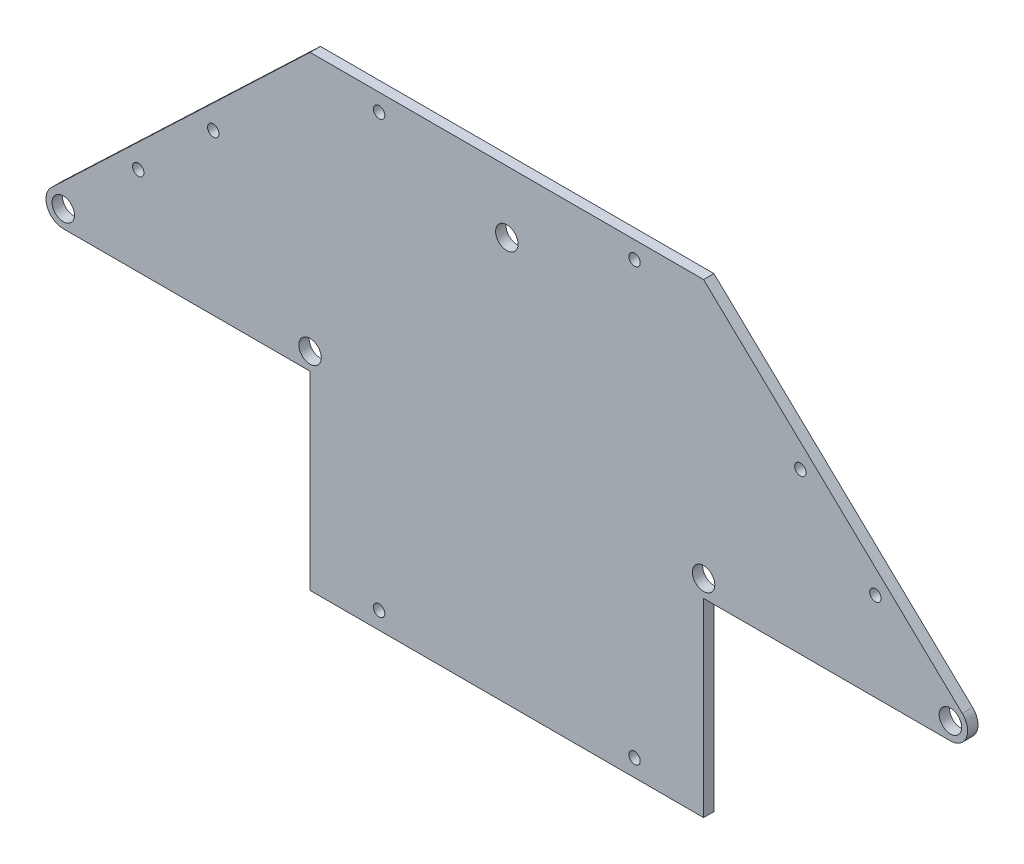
from build123d import *

# Parameters (mm, degrees)
SKETCH1_R      = 3.25
SKETCH1_R_2    = 1.65
EXTRUDE1_DEPTH = 3


with BuildPart() as part:
    # Sketch1 → Extrude1 (new body)
    with BuildSketch(Plane.XY):
        with BuildLine():
            Line((0, -5), (71.5, -5))
            Line((71.5, -5), (71.5, -60))
            Line((71.5, -60), (185.5, -60))
            Line((185.5, -60), (185.5, -5))
            Line((185.5, -5), (257, -5))
            ThreePointArc((257, -5), (261.642383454, -1.856953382), (260.448275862, 3.620689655))
            Line((260.448275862, 3.620689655), (185.5, 75))
            Line((185.5, 75), (71.5, 75))
            Line((71.5, 75), (-3.448275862, 3.620689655))
            ThreePointArc((-3.448275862, 3.620689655), (-4.642383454, -1.856953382), (0, -5))
        make_face()
        Circle(SKETCH1_R, mode=Mode.SUBTRACT)
        with Locations((257, 0)):
            Circle(SKETCH1_R, mode=Mode.SUBTRACT)
        with Locations((71.5, 0)):
            Circle(SKETCH1_R, mode=Mode.SUBTRACT)
        with Locations((185.5, 0)):
            Circle(SKETCH1_R, mode=Mode.SUBTRACT)
        with Locations((128.5, 57)):
            Circle(SKETCH1_R, mode=Mode.SUBTRACT)
        with Locations((43.448275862, 41.379310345)):
            Circle(SKETCH1_R_2, mode=Mode.SUBTRACT)
        with Locations((91.5, 70)):
            Circle(SKETCH1_R_2, mode=Mode.SUBTRACT)
        with Locations((165.5, 70)):
            Circle(SKETCH1_R_2, mode=Mode.SUBTRACT)
        with Locations((213.551724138, 41.379310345)):
            Circle(SKETCH1_R_2, mode=Mode.SUBTRACT)
        with Locations((91.5, -55)):
            Circle(SKETCH1_R_2, mode=Mode.SUBTRACT)
        with Locations((165.5, -55)):
            Circle(SKETCH1_R_2, mode=Mode.SUBTRACT)
        with Locations((21.724137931, 20.689655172)):
            Circle(SKETCH1_R_2, mode=Mode.SUBTRACT)
        with Locations((235.275862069, 20.689655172)):
            Circle(SKETCH1_R_2, mode=Mode.SUBTRACT)
    extrude(amount=EXTRUDE1_DEPTH)


solid = part.part
